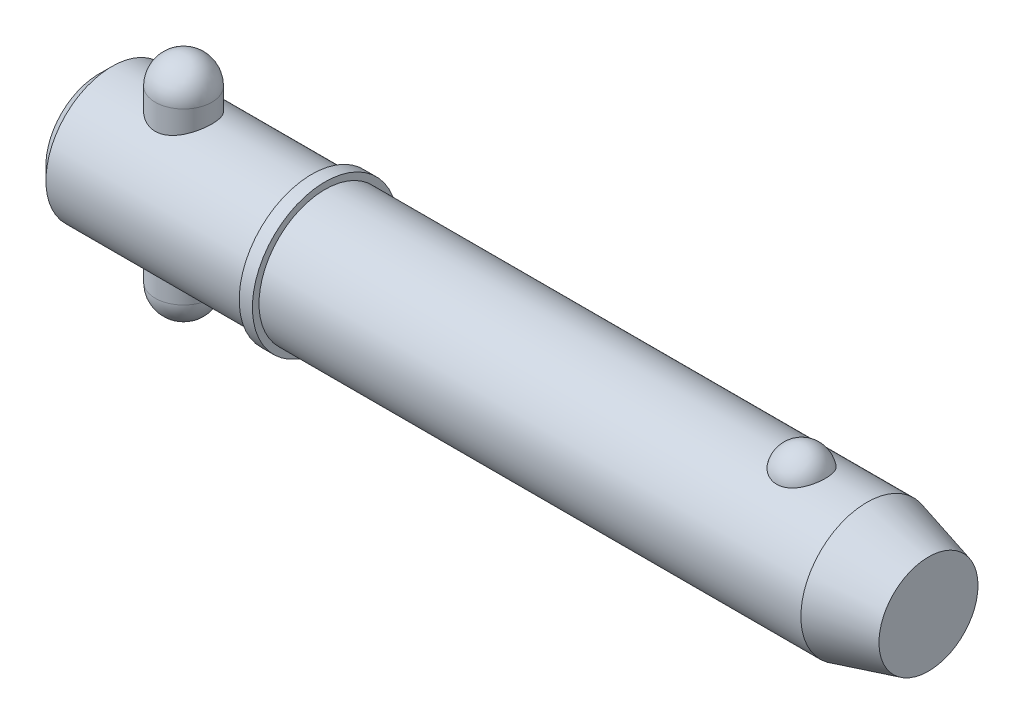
ISO-10303-21;
HEADER;
FILE_DESCRIPTION(('STEP AP214'),'2;1');
FILE_NAME('part.step','',(''),(''),'','','');
FILE_SCHEMA(('AUTOMOTIVE_DESIGN { 1 0 10303 214 1 1 1 1 }'));
ENDSEC;
DATA;
#1=APPLICATION_CONTEXT('core data for automotive mechanical design processes');
#2=APPLICATION_PROTOCOL_DEFINITION('international standard','automotive_design',2000,#1);
#3=PRODUCT_CONTEXT('',#1,'mechanical');
#4=PRODUCT('Part','Part','',(#3));
#5=PRODUCT_RELATED_PRODUCT_CATEGORY('part','',(#4));
#6=PRODUCT_DEFINITION_FORMATION('','',#4);
#7=PRODUCT_DEFINITION_CONTEXT('part definition',#1,'design');
#8=PRODUCT_DEFINITION('design','',#6,#7);
#9=PRODUCT_DEFINITION_SHAPE('','',#8);
#10=(LENGTH_UNIT() NAMED_UNIT(*) SI_UNIT(.MILLI.,.METRE.));
#11=(NAMED_UNIT(*) PLANE_ANGLE_UNIT() SI_UNIT($,.RADIAN.));
#12=(NAMED_UNIT(*) SI_UNIT($,.STERADIAN.) SOLID_ANGLE_UNIT());
#13=UNCERTAINTY_MEASURE_WITH_UNIT(LENGTH_MEASURE(1.E-05),#10,'distance_accuracy_value','');
#14=(GEOMETRIC_REPRESENTATION_CONTEXT(3) GLOBAL_UNCERTAINTY_ASSIGNED_CONTEXT((#13)) GLOBAL_UNIT_ASSIGNED_CONTEXT((#10,
#11,#12)) REPRESENTATION_CONTEXT('',''));
#15=CARTESIAN_POINT('',(0.,0.,0.));
#16=DIRECTION('',(0.,0.,1.));
#17=DIRECTION('',(1.,0.,0.));
#18=AXIS2_PLACEMENT_3D('',#15,#16,#17);
#19=CARTESIAN_POINT('',(14.28,19.05,0.));
#20=DIRECTION('',(0.,-1.,0.));
#21=DIRECTION('',(0.,0.,-1.));
#22=AXIS2_PLACEMENT_3D('',#19,#20,#21);
#23=CYLINDRICAL_SURFACE('',#22,4.76);
#24=CARTESIAN_POINT('',(14.28,-14.29,0.));
#25=DIRECTION('',(0.,-1.,0.));
#26=DIRECTION('',(0.,0.,-1.));
#27=AXIS2_PLACEMENT_3D('',#24,#25,#26);
#28=CIRCLE('',#27,4.76);
#29=CARTESIAN_POINT('',(14.28,-14.29,-4.76));
#30=VERTEX_POINT('',#29);
#31=EDGE_CURVE('P0_E10',#30,#30,#28,.F.);
#32=CARTESIAN_POINT('',(14.28,14.29,0.));
#33=DIRECTION('',(0.,-1.,0.));
#34=DIRECTION('',(0.,0.,-1.));
#35=AXIS2_PLACEMENT_3D('',#32,#33,#34);
#36=CIRCLE('',#35,4.76);
#37=CARTESIAN_POINT('',(14.28,14.29,-4.76));
#38=VERTEX_POINT('',#37);
#39=EDGE_CURVE('P0_E21',#38,#38,#36,.T.);
#40=CARTESIAN_POINT('',(14.28,-14.29,-4.76));
#41=CARTESIAN_POINT('',(14.28,-13.9922916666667,-4.76));
#42=CARTESIAN_POINT('',(14.28,-13.6945833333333,-4.76));
#43=CARTESIAN_POINT('',(14.28,-13.0991666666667,-4.76));
#44=CARTESIAN_POINT('',(14.28,-12.8014583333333,-4.76));
#45=CARTESIAN_POINT('',(14.28,-12.2060416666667,-4.76));
#46=CARTESIAN_POINT('',(14.28,-11.9083333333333,-4.76));
#47=CARTESIAN_POINT('',(14.28,-11.3129166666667,-4.76));
#48=CARTESIAN_POINT('',(14.28,-11.0152083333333,-4.76));
#49=CARTESIAN_POINT('',(14.28,-10.4197916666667,-4.76));
#50=CARTESIAN_POINT('',(14.28,-10.1220833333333,-4.76));
#51=CARTESIAN_POINT('',(14.28,-9.52666666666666,-4.76));
#52=CARTESIAN_POINT('',(14.28,-9.22895833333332,-4.76));
#53=CARTESIAN_POINT('',(14.28,-8.63354166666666,-4.76));
#54=CARTESIAN_POINT('',(14.28,-8.33583333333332,-4.76));
#55=CARTESIAN_POINT('',(14.28,-7.74041666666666,-4.76));
#56=CARTESIAN_POINT('',(14.28,-7.44270833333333,-4.76));
#57=CARTESIAN_POINT('',(14.28,-6.84729166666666,-4.76));
#58=CARTESIAN_POINT('',(14.28,-6.54958333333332,-4.76));
#59=CARTESIAN_POINT('',(14.28,-5.95416666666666,-4.76));
#60=CARTESIAN_POINT('',(14.28,-5.65645833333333,-4.76));
#61=CARTESIAN_POINT('',(14.28,-5.06104166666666,-4.76));
#62=CARTESIAN_POINT('',(14.28,-4.76333333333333,-4.76));
#63=CARTESIAN_POINT('',(14.28,-4.16791666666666,-4.76));
#64=CARTESIAN_POINT('',(14.28,-3.87020833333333,-4.76));
#65=CARTESIAN_POINT('',(14.28,-3.27479166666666,-4.76));
#66=CARTESIAN_POINT('',(14.28,-2.97708333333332,-4.76));
#67=CARTESIAN_POINT('',(14.28,-2.38166666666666,-4.76));
#68=CARTESIAN_POINT('',(14.28,-2.08395833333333,-4.76));
#69=CARTESIAN_POINT('',(14.28,-1.48854166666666,-4.76));
#70=CARTESIAN_POINT('',(14.28,-1.19083333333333,-4.76));
#71=CARTESIAN_POINT('',(14.28,-0.595416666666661,-4.76));
#72=CARTESIAN_POINT('',(14.28,-0.297708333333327,-4.76));
#73=CARTESIAN_POINT('',(14.28,0.297708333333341,-4.76));
#74=CARTESIAN_POINT('',(14.28,0.595416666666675,-4.76));
#75=CARTESIAN_POINT('',(14.28,1.19083333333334,-4.76));
#76=CARTESIAN_POINT('',(14.28,1.48854166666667,-4.76));
#77=CARTESIAN_POINT('',(14.28,2.08395833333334,-4.76));
#78=CARTESIAN_POINT('',(14.28,2.38166666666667,-4.76));
#79=CARTESIAN_POINT('',(14.28,2.97708333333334,-4.76));
#80=CARTESIAN_POINT('',(14.28,3.27479166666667,-4.76));
#81=CARTESIAN_POINT('',(14.28,3.87020833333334,-4.76));
#82=CARTESIAN_POINT('',(14.28,4.16791666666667,-4.76));
#83=CARTESIAN_POINT('',(14.28,4.76333333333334,-4.76));
#84=CARTESIAN_POINT('',(14.28,5.06104166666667,-4.76));
#85=CARTESIAN_POINT('',(14.28,5.65645833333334,-4.76));
#86=CARTESIAN_POINT('',(14.28,5.95416666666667,-4.76));
#87=CARTESIAN_POINT('',(14.28,6.54958333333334,-4.76));
#88=CARTESIAN_POINT('',(14.28,6.84729166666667,-4.76));
#89=CARTESIAN_POINT('',(14.28,7.44270833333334,-4.76));
#90=CARTESIAN_POINT('',(14.28,7.74041666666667,-4.76));
#91=CARTESIAN_POINT('',(14.28,8.33583333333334,-4.76));
#92=CARTESIAN_POINT('',(14.28,8.63354166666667,-4.76));
#93=CARTESIAN_POINT('',(14.28,9.22895833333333,-4.76));
#94=CARTESIAN_POINT('',(14.28,9.52666666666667,-4.76));
#95=CARTESIAN_POINT('',(14.28,10.1220833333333,-4.76));
#96=CARTESIAN_POINT('',(14.28,10.4197916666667,-4.76));
#97=CARTESIAN_POINT('',(14.28,11.0152083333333,-4.76));
#98=CARTESIAN_POINT('',(14.28,11.3129166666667,-4.76));
#99=CARTESIAN_POINT('',(14.28,11.9083333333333,-4.76));
#100=CARTESIAN_POINT('',(14.28,12.2060416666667,-4.76));
#101=CARTESIAN_POINT('',(14.28,12.8014583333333,-4.76));
#102=CARTESIAN_POINT('',(14.28,13.0991666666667,-4.76));
#103=CARTESIAN_POINT('',(14.28,13.6945833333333,-4.76));
#104=CARTESIAN_POINT('',(14.28,13.9922916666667,-4.76));
#105=CARTESIAN_POINT('',(14.28,14.29,-4.76));
#106=B_SPLINE_CURVE_WITH_KNOTS('',3,(#40,#41,#42,#43,#44,#45,#46,#47,#48,#49,#50,#51,#52,#53,
#54,#55,#56,#57,#58,#59,#60,#61,#62,#63,#64,#65,#66,#67,#68,#69,#70,#71,#72,#73,#74,#75,#76,#77,
#78,#79,#80,#81,#82,#83,#84,#85,#86,#87,#88,#89,#90,#91,#92,#93,#94,#95,#96,#97,#98,#99,#100,
#101,#102,#103,#104,#105),.UNSPECIFIED.,.F.,.F.,(4,2,2,2,2,2,2,2,2,2,2,2,2,2,2,2,2,2,2,2,2,2,2,
2,2,2,2,2,2,2,2,2,4),(0.,0.893125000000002,1.78625,2.67937499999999,3.5725,4.465625,5.35875,
6.25187499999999,7.145,8.038125,8.93125,9.82437499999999,10.7175,11.610625,12.50375,13.396875,
14.29,15.183125,16.07625,16.969375,17.8625,18.755625,19.64875,20.541875,21.435,22.328125,
23.22125,24.114375,25.0075,25.900625,26.79375,27.686875,28.58),.UNSPECIFIED.);
#107=EDGE_CURVE('P0_BSEAM14',#30,#38,#106,.T.);
#108=ORIENTED_EDGE('',*,*,#31,.T.);
#109=ORIENTED_EDGE('',*,*,#39,.T.);
#110=ORIENTED_EDGE('',*,*,#107,.T.);
#111=ORIENTED_EDGE('',*,*,#107,.F.);
#112=EDGE_LOOP('',(#108,#110,#109,#111));
#113=FACE_BOUND('',#112,.T.);
#114=ADVANCED_FACE('P0_F14',(#113),#23,.T.);
#115=CARTESIAN_POINT('',(14.28,-14.29,0.));
#116=DIRECTION('',(0.,0.,1.));
#117=DIRECTION('',(1.,0.,0.));
#118=AXIS2_PLACEMENT_3D('',#115,#116,#117);
#119=SPHERICAL_SURFACE('',#118,4.76);
#120=CARTESIAN_POINT('',(14.28,-14.29,0.));
#121=DIRECTION('',(0.,-1.,0.));
#122=DIRECTION('',(0.,0.,-1.));
#123=AXIS2_PLACEMENT_3D('',#120,#121,#122);
#124=SPHERICAL_SURFACE('',#123,4.76);
#125=ORIENTED_EDGE('',*,*,#31,.F.);
#126=EDGE_LOOP('',(#125));
#127=FACE_BOUND('',#126,.T.);
#128=ADVANCED_FACE('P0_F29',(#127),#124,.T.);
#129=CARTESIAN_POINT('',(14.28,14.29,0.));
#130=DIRECTION('',(0.,0.,1.));
#131=DIRECTION('',(1.,0.,0.));
#132=AXIS2_PLACEMENT_3D('',#129,#130,#131);
#133=SPHERICAL_SURFACE('',#132,4.76);
#134=CARTESIAN_POINT('',(14.28,14.29,0.));
#135=DIRECTION('',(0.,-1.,0.));
#136=DIRECTION('',(0.,0.,-1.));
#137=AXIS2_PLACEMENT_3D('',#134,#135,#136);
#138=SPHERICAL_SURFACE('',#137,4.76);
#139=ORIENTED_EDGE('',*,*,#39,.F.);
#140=EDGE_LOOP('',(#139));
#141=FACE_BOUND('',#140,.T.);
#142=ADVANCED_FACE('P0_F16',(#141),#138,.T.);
#143=CLOSED_SHELL('',(#114,#128,#142));
#144=MANIFOLD_SOLID_BREP('P0_B1',#143);
#145=CARTESIAN_POINT('',(0.,0.,0.));
#146=DIRECTION('',(1.,0.,0.));
#147=DIRECTION('',(0.,0.,-1.));
#148=AXIS2_PLACEMENT_3D('',#145,#146,#147);
#149=CYLINDRICAL_SURFACE('',#148,11.115);
#150=CARTESIAN_POINT('',(129.329563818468,0.,0.));
#151=DIRECTION('',(1.,0.,0.));
#152=DIRECTION('',(0.,0.,-1.));
#153=AXIS2_PLACEMENT_3D('',#150,#151,#152);
#154=CIRCLE('',#153,11.115);
#155=CARTESIAN_POINT('',(129.329563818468,0.,-11.115));
#156=VERTEX_POINT('',#155);
#157=EDGE_CURVE('P1_E81',#156,#156,#154,.T.);
#158=ORIENTED_EDGE('',*,*,#157,.F.);
#159=EDGE_LOOP('',(#158));
#160=FACE_BOUND('',#159,.T.);
#161=CARTESIAN_POINT('',(38.1,0.,0.));
#162=DIRECTION('',(1.,0.,0.));
#163=DIRECTION('',(0.,0.,-1.));
#164=AXIS2_PLACEMENT_3D('',#161,#162,#163);
#165=CIRCLE('',#164,11.115);
#166=CARTESIAN_POINT('',(38.1,0.,-11.115));
#167=VERTEX_POINT('',#166);
#168=EDGE_CURVE('P1_E85',#167,#167,#165,.T.);
#169=ORIENTED_EDGE('',*,*,#168,.T.);
#170=EDGE_LOOP('',(#169));
#171=FACE_BOUND('',#170,.T.);
#172=CARTESIAN_POINT('',(118.331068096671,10.3028087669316,4.17077409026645));
#173=CARTESIAN_POINT('',(118.114775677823,10.3028003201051,4.17078240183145));
#174=CARTESIAN_POINT('',(117.898548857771,10.3098895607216,4.15340593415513));
#175=CARTESIAN_POINT('',(117.472540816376,10.3373834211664,4.08449540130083));
#176=CARTESIAN_POINT('',(117.262757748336,10.3577841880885,4.0329712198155));
#177=CARTESIAN_POINT('',(116.855782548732,10.4095237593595,3.89746513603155));
#178=CARTESIAN_POINT('',(116.658572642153,10.4408466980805,3.81353029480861));
#179=CARTESIAN_POINT('',(116.281338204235,10.5110236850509,3.61560339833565));
#180=CARTESIAN_POINT('',(116.101317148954,10.5498792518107,3.50160528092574));
#181=CARTESIAN_POINT('',(115.757684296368,10.6322884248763,3.24292464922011));
#182=CARTESIAN_POINT('',(115.594686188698,10.6759443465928,3.09746040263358));
#183=CARTESIAN_POINT('',(115.294591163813,10.7625291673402,2.78171925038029));
#184=CARTESIAN_POINT('',(115.157499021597,10.8054579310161,2.61143778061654));
#185=CARTESIAN_POINT('',(114.906408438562,10.8881935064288,2.24226695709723));
#186=CARTESIAN_POINT('',(114.793710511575,10.9277761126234,2.04244123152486));
#187=CARTESIAN_POINT('',(114.601777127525,10.997484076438,1.62578254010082));
#188=CARTESIAN_POINT('',(114.522544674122,11.0276085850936,1.40894804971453));
#189=CARTESIAN_POINT('',(114.398303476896,11.0756732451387,0.961250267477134));
#190=CARTESIAN_POINT('',(114.353760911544,11.0934470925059,0.730239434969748));
#191=CARTESIAN_POINT('',(114.301569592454,11.1143331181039,0.263439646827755));
#192=CARTESIAN_POINT('',(114.293920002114,11.1174456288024,0.0276507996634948));
#193=CARTESIAN_POINT('',(114.31561056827,11.1087161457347,-0.440729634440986));
#194=CARTESIAN_POINT('',(114.344762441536,11.0969502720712,-0.673331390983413));
#195=CARTESIAN_POINT('',(114.439143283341,11.0597872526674,-1.12996621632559));
#196=CARTESIAN_POINT('',(114.504372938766,11.0343898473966,-1.35399912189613));
#197=CARTESIAN_POINT('',(114.66969844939,10.972515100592,-1.78750286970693));
#198=CARTESIAN_POINT('',(114.76983863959,10.9360236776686,-1.99695478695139));
#199=CARTESIAN_POINT('',(115.002940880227,10.8557595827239,-2.39520667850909));
#200=CARTESIAN_POINT('',(115.135905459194,10.8119863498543,-2.5840050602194));
#201=CARTESIAN_POINT('',(115.432407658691,10.7216733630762,-2.93635726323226));
#202=CARTESIAN_POINT('',(115.596056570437,10.675123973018,-3.09981510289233));
#203=CARTESIAN_POINT('',(115.949860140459,10.5846571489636,-3.39592247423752));
#204=CARTESIAN_POINT('',(116.140012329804,10.5407394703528,-3.52857487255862));
#205=CARTESIAN_POINT('',(116.53750141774,10.4616690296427,-3.75646057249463));
#206=CARTESIAN_POINT('',(116.74436705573,10.4263443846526,-3.8524543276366));
#207=CARTESIAN_POINT('',(117.172954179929,10.3675574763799,-4.00798747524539));
#208=CARTESIAN_POINT('',(117.394670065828,10.344090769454,-4.0675405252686));
#209=CARTESIAN_POINT('',(117.834669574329,10.3128282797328,-4.14614314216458));
#210=CARTESIAN_POINT('',(118.052565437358,10.3043040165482,-4.1670783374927));
#211=CARTESIAN_POINT('',(118.48894951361,10.3016771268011,-4.17357158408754));
#212=CARTESIAN_POINT('',(118.707437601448,10.3075716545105,-4.15913661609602));
#213=CARTESIAN_POINT('',(119.131744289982,10.3326686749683,-4.09636961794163));
#214=CARTESIAN_POINT('',(119.337745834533,10.3514555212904,-4.0490957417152));
#215=CARTESIAN_POINT('',(119.738576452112,10.399818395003,-3.92320197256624));
#216=CARTESIAN_POINT('',(119.9334046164,10.4293952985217,-3.84457953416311));
#217=CARTESIAN_POINT('',(120.311191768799,10.4969600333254,-3.65612410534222));
#218=CARTESIAN_POINT('',(120.493797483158,10.5351178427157,-3.54564545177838));
#219=CARTESIAN_POINT('',(120.838204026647,10.6154999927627,-3.29718036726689));
#220=CARTESIAN_POINT('',(121.000000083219,10.657725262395,-3.15918764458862));
#221=CARTESIAN_POINT('',(121.306959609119,10.744212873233,-2.85163580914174));
#222=CARTESIAN_POINT('',(121.450891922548,10.7884718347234,-2.68084605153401));
#223=CARTESIAN_POINT('',(121.709237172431,10.872374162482,-2.3172186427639));
#224=CARTESIAN_POINT('',(121.823644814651,10.9120167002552,-2.12437704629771));
#225=CARTESIAN_POINT('',(122.023873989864,10.9838919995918,-1.71516999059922));
#226=CARTESIAN_POINT('',(122.10866178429,11.0158465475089,-1.498248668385));
#227=CARTESIAN_POINT('',(122.24268382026,11.0673523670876,-1.052285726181));
#228=CARTESIAN_POINT('',(122.291917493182,11.086903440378,-0.823243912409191));
#229=CARTESIAN_POINT('',(122.353891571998,11.1116323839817,-0.359087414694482));
#230=CARTESIAN_POINT('',(122.366566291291,11.1167843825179,-0.123962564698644));
#231=CARTESIAN_POINT('',(122.354973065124,11.1121144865,0.345220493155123));
#232=CARTESIAN_POINT('',(122.330705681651,11.1022928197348,0.579278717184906));
#233=CARTESIAN_POINT('',(122.245907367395,11.0687504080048,1.03866534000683));
#234=CARTESIAN_POINT('',(122.185529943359,11.0450885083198,1.26402641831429));
#235=CARTESIAN_POINT('',(122.029853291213,10.9863185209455,1.70076772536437));
#236=CARTESIAN_POINT('',(121.934551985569,10.9512097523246,1.91214712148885));
#237=CARTESIAN_POINT('',(121.710397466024,10.8729733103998,2.31608359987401));
#238=CARTESIAN_POINT('',(121.581380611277,10.8298068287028,2.50854240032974));
#239=CARTESIAN_POINT('',(121.292732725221,10.7401896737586,2.86808766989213));
#240=CARTESIAN_POINT('',(121.133102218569,10.6937390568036,3.03517457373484));
#241=CARTESIAN_POINT('',(120.787534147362,10.6029321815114,3.33857581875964));
#242=CARTESIAN_POINT('',(120.601708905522,10.5585680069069,3.47501541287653));
#243=CARTESIAN_POINT('',(120.207875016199,10.4769321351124,3.71390897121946));
#244=CARTESIAN_POINT('',(119.999863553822,10.439661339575,3.81635861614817));
#245=CARTESIAN_POINT('',(119.554066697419,10.3749407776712,3.98910631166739));
#246=CARTESIAN_POINT('',(119.315234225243,10.3482457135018,4.05700929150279));
#247=CARTESIAN_POINT('',(118.827925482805,10.312188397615,4.14782844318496));
#248=CARTESIAN_POINT('',(118.579453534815,10.3028184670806,4.17076454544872));
#249=CARTESIAN_POINT('',(118.331068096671,10.3028087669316,4.17077409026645));
#250=B_SPLINE_CURVE_WITH_KNOTS('',3,(#172,#173,#174,#175,#176,#177,#178,#179,#180,#181,#182,
#183,#184,#185,#186,#187,#188,#189,#190,#191,#192,#193,#194,#195,#196,#197,#198,#199,#200,#201,
#202,#203,#204,#205,#206,#207,#208,#209,#210,#211,#212,#213,#214,#215,#216,#217,#218,#219,#220,
#221,#222,#223,#224,#225,#226,#227,#228,#229,#230,#231,#232,#233,#234,#235,#236,#237,#238,#239,
#240,#241,#242,#243,#244,#245,#246,#247,#248,#249),.UNSPECIFIED.,.T.,.F.,(4,2,2,2,2,2,2,2,2,2,2,
2,2,2,2,2,2,2,2,2,2,2,2,2,2,2,2,2,2,2,2,2,2,2,2,2,2,2,4),(0.,0.647966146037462,1.29574482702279,
1.94258643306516,2.58955857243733,3.25496465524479,3.92049326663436,4.61566368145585,
5.3108964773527,6.01531821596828,6.71972398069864,7.42054043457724,8.12137023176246,
8.82309331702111,9.52487047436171,10.2292439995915,10.9335519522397,11.6223330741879,
12.3108558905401,12.9647664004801,13.6185478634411,14.2521847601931,14.8858731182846,
15.5334360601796,16.1811472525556,16.8611459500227,17.5412664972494,18.2431855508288,
18.9451158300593,19.6483065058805,20.3514864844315,21.0516982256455,21.7519516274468,
22.4556690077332,23.1593743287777,23.8601491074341,24.5610129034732,25.3054529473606,
26.049562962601),.UNSPECIFIED.);
#251=CARTESIAN_POINT('',(118.331068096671,10.3028087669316,4.17077409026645));
#252=VERTEX_POINT('',#251);
#253=EDGE_CURVE('P1_E35',#252,#252,#250,.T.);
#254=ORIENTED_EDGE('',*,*,#253,.T.);
#255=EDGE_LOOP('',(#254));
#256=FACE_BOUND('',#255,.T.);
#257=ADVANCED_FACE('P1_F13',(#160,#171,#256),#149,.T.);
#258=CARTESIAN_POINT('',(0.,0.,0.));
#259=DIRECTION('',(-1.,0.,0.));
#260=DIRECTION('',(0.,0.,1.));
#261=AXIS2_PLACEMENT_3D('',#258,#259,#260);
#262=PLANE('',#261);
#263=CARTESIAN_POINT('',(0.,0.,0.));
#264=DIRECTION('',(1.,0.,0.));
#265=DIRECTION('',(0.,0.,-1.));
#266=AXIS2_PLACEMENT_3D('',#263,#264,#265);
#267=CIRCLE('',#266,8.892);
#268=CARTESIAN_POINT('',(0.,0.,-8.892));
#269=VERTEX_POINT('',#268);
#270=EDGE_CURVE('P1_E9',#269,#269,#267,.T.);
#271=ORIENTED_EDGE('',*,*,#270,.F.);
#272=EDGE_LOOP('',(#271));
#273=FACE_BOUND('',#272,.T.);
#274=ADVANCED_FACE('P1_F15',(#273),#262,.T.);
#275=CARTESIAN_POINT('',(2.22299999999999,0.,0.));
#276=DIRECTION('',(1.,0.,0.));
#277=DIRECTION('',(0.,0.,-1.));
#278=AXIS2_PLACEMENT_3D('',#275,#276,#277);
#279=CONICAL_SURFACE('',#278,11.115,0.78539816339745);
#280=ORIENTED_EDGE('',*,*,#270,.T.);
#281=EDGE_LOOP('',(#280));
#282=FACE_BOUND('',#281,.T.);
#283=CARTESIAN_POINT('',(2.22299999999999,0.,0.));
#284=DIRECTION('',(1.,0.,0.));
#285=DIRECTION('',(0.,0.,-1.));
#286=AXIS2_PLACEMENT_3D('',#283,#284,#285);
#287=CIRCLE('',#286,11.115);
#288=CARTESIAN_POINT('',(2.22299999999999,0.,-11.115));
#289=VERTEX_POINT('',#288);
#290=EDGE_CURVE('P1_E26',#289,#289,#287,.T.);
#291=ORIENTED_EDGE('',*,*,#290,.F.);
#292=EDGE_LOOP('',(#291));
#293=FACE_BOUND('',#292,.T.);
#294=ADVANCED_FACE('P1_F77',(#282,#293),#279,.T.);
#295=CARTESIAN_POINT('',(0.,0.,0.));
#296=DIRECTION('',(1.,0.,0.));
#297=DIRECTION('',(0.,0.,-1.));
#298=AXIS2_PLACEMENT_3D('',#295,#296,#297);
#299=CYLINDRICAL_SURFACE('',#298,11.115);
#300=CARTESIAN_POINT('',(14.28,-10.0441836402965,4.76));
#301=CARTESIAN_POINT('',(14.1533731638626,-10.0441846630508,4.75999904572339));
#302=CARTESIAN_POINT('',(14.0267055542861,-10.0465865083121,4.75493985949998));
#303=CARTESIAN_POINT('',(13.774298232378,-10.0561141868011,4.73475585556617));
#304=CARTESIAN_POINT('',(13.6485591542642,-10.0632429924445,4.71962470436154));
#305=CARTESIAN_POINT('',(13.3987500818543,-10.0819979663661,4.67942666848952));
#306=CARTESIAN_POINT('',(13.2746840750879,-10.0936334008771,4.65433930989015));
#307=CARTESIAN_POINT('',(13.0293244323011,-10.1210146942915,4.59449317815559));
#308=CARTESIAN_POINT('',(12.9080319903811,-10.1367622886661,4.55973032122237));
#309=CARTESIAN_POINT('',(12.669614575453,-10.1717810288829,4.48106435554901));
#310=CARTESIAN_POINT('',(12.5524727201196,-10.1910352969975,4.4372048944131));
#311=CARTESIAN_POINT('',(12.3224300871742,-10.2325403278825,4.34063417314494));
#312=CARTESIAN_POINT('',(12.2095309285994,-10.2547922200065,4.28791957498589));
#313=CARTESIAN_POINT('',(11.8782785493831,-10.3250879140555,4.11715127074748));
#314=CARTESIAN_POINT('',(11.6670799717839,-10.3767168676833,3.98637638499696));
#315=CARTESIAN_POINT('',(11.2564039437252,-10.4874309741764,3.68567149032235));
#316=CARTESIAN_POINT('',(11.0583793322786,-10.5467772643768,3.51386978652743));
#317=CARTESIAN_POINT('',(10.6927724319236,-10.6641377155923,3.13969960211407));
#318=CARTESIAN_POINT('',(10.5252022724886,-10.7221513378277,2.93731900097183));
#319=CARTESIAN_POINT('',(10.2965609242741,-10.8050020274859,2.60935726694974));
#320=CARTESIAN_POINT('',(10.2227768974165,-10.8324811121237,2.49310321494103));
#321=CARTESIAN_POINT('',(10.0853380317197,-10.884703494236,2.25418999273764));
#322=CARTESIAN_POINT('',(10.0216789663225,-10.9094479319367,2.13153352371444));
#323=CARTESIAN_POINT('',(9.90506238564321,-10.9554932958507,1.88060370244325));
#324=CARTESIAN_POINT('',(9.85210574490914,-10.9767939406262,1.7523298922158));
#325=CARTESIAN_POINT('',(9.75746464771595,-11.0153112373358,1.49115740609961));
#326=CARTESIAN_POINT('',(9.71577447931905,-11.0325299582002,1.35826111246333));
#327=CARTESIAN_POINT('',(9.64605475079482,-11.0615607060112,1.09614539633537));
#328=CARTESIAN_POINT('',(9.61740732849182,-11.0736151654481,0.96711700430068));
#329=CARTESIAN_POINT('',(9.57092026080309,-11.0932687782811,0.706847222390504));
#330=CARTESIAN_POINT('',(9.55307574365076,-11.1008699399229,0.575606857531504));
#331=CARTESIAN_POINT('',(9.52838640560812,-11.1114054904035,0.31192917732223));
#332=CARTESIAN_POINT('',(9.52153986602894,-11.114340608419,0.179492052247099));
#333=CARTESIAN_POINT('',(9.51892405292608,-11.1154607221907,-0.0855090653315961));
#334=CARTESIAN_POINT('',(9.52315432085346,-11.1136459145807,-0.218073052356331));
#335=CARTESIAN_POINT('',(9.542009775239,-11.1055891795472,-0.473709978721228));
#336=CARTESIAN_POINT('',(9.55594693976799,-11.099640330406,-0.596843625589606));
#337=CARTESIAN_POINT('',(9.59332832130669,-11.0837823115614,-0.841440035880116));
#338=CARTESIAN_POINT('',(9.61677567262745,-11.0738718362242,-0.962902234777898));
#339=CARTESIAN_POINT('',(9.67294089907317,-11.0503378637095,-1.20325684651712));
#340=CARTESIAN_POINT('',(9.70565569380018,-11.0367156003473,-1.32215009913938));
#341=CARTESIAN_POINT('',(9.78005008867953,-11.0060908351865,-1.55666640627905));
#342=CARTESIAN_POINT('',(9.82173311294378,-10.9890870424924,-1.67228819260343));
#343=CARTESIAN_POINT('',(9.96110379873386,-10.9330280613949,-2.01656166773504));
#344=CARTESIAN_POINT('',(10.0722987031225,-10.8892801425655,-2.23915547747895));
#345=CARTESIAN_POINT('',(10.3268588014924,-10.7934745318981,-2.66299199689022));
#346=CARTESIAN_POINT('',(10.4702355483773,-10.7414138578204,-2.86422700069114));
#347=CARTESIAN_POINT('',(10.7973904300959,-10.6296201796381,-3.25557775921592));
#348=CARTESIAN_POINT('',(10.9833705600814,-10.569604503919,-3.443774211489));
#349=CARTESIAN_POINT('',(11.3844486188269,-10.4514707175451,-3.78722133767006));
#350=CARTESIAN_POINT('',(11.5995590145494,-10.3933534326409,-3.94245783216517));
#351=CARTESIAN_POINT('',(11.9444340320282,-10.311516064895,-4.14990014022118));
#352=CARTESIAN_POINT('',(12.0654579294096,-10.2847012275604,-4.21573894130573));
#353=CARTESIAN_POINT('',(12.3132718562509,-10.2342051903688,-4.33688518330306));
#354=CARTESIAN_POINT('',(12.4400593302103,-10.2105226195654,-4.39219723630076));
#355=CARTESIAN_POINT('',(12.6985418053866,-10.1671237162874,-4.49174500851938));
#356=CARTESIAN_POINT('',(12.8302359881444,-10.1474067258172,-4.53598256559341));
#357=CARTESIAN_POINT('',(13.0975061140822,-10.1126841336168,-4.61287629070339));
#358=CARTESIAN_POINT('',(13.233079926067,-10.0976759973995,-4.64553869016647));
#359=CARTESIAN_POINT('',(13.4978553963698,-10.0737863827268,-4.6971059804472));
#360=CARTESIAN_POINT('',(13.6268754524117,-10.0645618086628,-4.716785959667));
#361=CARTESIAN_POINT('',(13.8862990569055,-10.051062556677,-4.74548419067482));
#362=CARTESIAN_POINT('',(14.0167019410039,-10.0467856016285,-4.75450734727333));
#363=CARTESIAN_POINT('',(14.277859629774,-10.0433352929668,-4.76179143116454));
#364=CARTESIAN_POINT('',(14.4086143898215,-10.0441613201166,-4.76005366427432));
#365=CARTESIAN_POINT('',(14.6694025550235,-10.0508838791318,-4.74584231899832));
#366=CARTESIAN_POINT('',(14.7994359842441,-10.0567802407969,-4.73336910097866));
#367=CARTESIAN_POINT('',(15.0487369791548,-10.0728449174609,-4.69907984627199));
#368=CARTESIAN_POINT('',(15.1681238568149,-10.0826872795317,-4.67797462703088));
#369=CARTESIAN_POINT('',(15.4045894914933,-10.1062580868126,-4.62682977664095));
#370=CARTESIAN_POINT('',(15.5216674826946,-10.1199877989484,-4.59678723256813));
#371=CARTESIAN_POINT('',(15.868278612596,-10.1664161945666,-4.49365911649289));
#372=CARTESIAN_POINT('',(16.0933756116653,-10.2043671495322,-4.40754694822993));
#373=CARTESIAN_POINT('',(16.5357981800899,-10.2919879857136,-4.19898201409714));
#374=CARTESIAN_POINT('',(16.7523611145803,-10.3420954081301,-4.07511281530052));
#375=CARTESIAN_POINT('',(17.1627188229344,-10.4477911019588,-3.7959429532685));
#376=CARTESIAN_POINT('',(17.3565033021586,-10.5033818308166,-3.64062816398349));
#377=CARTESIAN_POINT('',(17.7334034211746,-10.6196376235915,-3.28693729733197));
#378=CARTESIAN_POINT('',(17.9141276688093,-10.6803237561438,-3.08599175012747));
#379=CARTESIAN_POINT('',(18.1582189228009,-10.7666348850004,-2.76320365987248));
#380=CARTESIAN_POINT('',(18.2351223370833,-10.7946346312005,-2.65197124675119));
#381=CARTESIAN_POINT('',(18.3793967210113,-10.8483267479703,-2.42297927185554));
#382=CARTESIAN_POINT('',(18.4467718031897,-10.87402011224,-2.30522255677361));
#383=CARTESIAN_POINT('',(18.5717669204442,-10.9225249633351,-2.06324665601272));
#384=CARTESIAN_POINT('',(18.6293326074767,-10.9453202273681,-1.93899615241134));
#385=CARTESIAN_POINT('',(18.73370006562,-10.9872100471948,-1.6855059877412));
#386=CARTESIAN_POINT('',(18.7805065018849,-11.0063062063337,-1.55626851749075));
#387=CARTESIAN_POINT('',(18.8628731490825,-11.0402419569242,-1.29375150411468));
#388=CARTESIAN_POINT('',(18.8984366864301,-11.0550828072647,-1.16047316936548));
#389=CARTESIAN_POINT('',(18.9579183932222,-11.0800638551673,-0.890912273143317));
#390=CARTESIAN_POINT('',(18.9818374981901,-11.0902044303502,-0.75462995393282));
#391=CARTESIAN_POINT('',(19.0164177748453,-11.104911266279,-0.490295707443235));
#392=CARTESIAN_POINT('',(19.027922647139,-11.1098318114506,-0.362373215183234));
#393=CARTESIAN_POINT('',(19.040554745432,-11.1152360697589,-0.105876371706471));
#394=CARTESIAN_POINT('',(19.0416784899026,-11.1157182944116,0.0226981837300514));
#395=CARTESIAN_POINT('',(19.0335275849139,-11.1122291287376,0.27938352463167));
#396=CARTESIAN_POINT('',(19.0242587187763,-11.1082602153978,0.407494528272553));
#397=CARTESIAN_POINT('',(18.9954320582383,-11.0959792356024,0.662388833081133));
#398=CARTESIAN_POINT('',(18.9758704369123,-11.0876655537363,0.789171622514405));
#399=CARTESIAN_POINT('',(18.9276379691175,-11.0673259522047,1.03545890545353));
#400=CARTESIAN_POINT('',(18.8993573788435,-11.0554596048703,1.15505309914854));
#401=CARTESIAN_POINT('',(18.8337694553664,-11.0282166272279,1.39134516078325));
#402=CARTESIAN_POINT('',(18.7964589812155,-11.0128387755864,1.5080420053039));
#403=CARTESIAN_POINT('',(18.671464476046,-10.9619666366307,1.85262797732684));
#404=CARTESIAN_POINT('',(18.5706772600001,-10.9217161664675,2.07521484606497));
#405=CARTESIAN_POINT('',(18.33202463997,-10.8301378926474,2.51061719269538));
#406=CARTESIAN_POINT('',(18.1926775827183,-10.7783885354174,2.72252375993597));
#407=CARTESIAN_POINT('',(17.8829747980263,-10.669863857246,3.12088015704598));
#408=CARTESIAN_POINT('',(17.7126068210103,-10.6130865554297,3.30731987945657));
#409=CARTESIAN_POINT('',(17.3310036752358,-10.495668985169,3.66358491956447));
#410=CARTESIAN_POINT('',(17.1177010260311,-10.4350471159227,3.83122543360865));
#411=CARTESIAN_POINT('',(16.7778915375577,-10.3495418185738,4.05420569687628));
#412=CARTESIAN_POINT('',(16.6612023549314,-10.3219229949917,4.12383380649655));
#413=CARTESIAN_POINT('',(16.4218466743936,-10.2693487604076,4.25306463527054));
#414=CARTESIAN_POINT('',(16.2991829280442,-10.2443921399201,4.31267191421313));
#415=CARTESIAN_POINT('',(16.0488008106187,-10.1979981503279,4.42126071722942));
#416=CARTESIAN_POINT('',(15.9210894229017,-10.1765561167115,4.47025635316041));
#417=CARTESIAN_POINT('',(15.6613937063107,-10.1379191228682,4.55720152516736));
#418=CARTESIAN_POINT('',(15.5294115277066,-10.1207220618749,4.59515652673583));
#419=CARTESIAN_POINT('',(15.2624981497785,-10.091252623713,4.65951684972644));
#420=CARTESIAN_POINT('',(15.1275757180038,-10.0789672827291,4.68595259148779));
#421=CARTESIAN_POINT('',(14.8556442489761,-10.0597530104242,4.72706206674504));
#422=CARTESIAN_POINT('',(14.7186368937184,-10.0528199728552,4.74174481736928));
#423=CARTESIAN_POINT('',(14.5310955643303,-10.047196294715,4.75363843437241));
#424=CARTESIAN_POINT('',(14.48091543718,-10.0460674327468,4.75602323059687));
#425=CARTESIAN_POINT('',(14.3804923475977,-10.044560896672,4.7592042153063));
#426=CARTESIAN_POINT('',(14.3302493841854,-10.0441832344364,4.76000037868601));
#427=CARTESIAN_POINT('',(14.28,-10.0441836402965,4.76));
#428=B_SPLINE_CURVE_WITH_KNOTS('',3,(#300,#301,#302,#303,#304,#305,#306,#307,#308,#309,#310,
#311,#312,#313,#314,#315,#316,#317,#318,#319,#320,#321,#322,#323,#324,#325,#326,#327,#328,#329,
#330,#331,#332,#333,#334,#335,#336,#337,#338,#339,#340,#341,#342,#343,#344,#345,#346,#347,#348,
#349,#350,#351,#352,#353,#354,#355,#356,#357,#358,#359,#360,#361,#362,#363,#364,#365,#366,#367,
#368,#369,#370,#371,#372,#373,#374,#375,#376,#377,#378,#379,#380,#381,#382,#383,#384,#385,#386,
#387,#388,#389,#390,#391,#392,#393,#394,#395,#396,#397,#398,#399,#400,#401,#402,#403,#404,#405,
#406,#407,#408,#409,#410,#411,#412,#413,#414,#415,#416,#417,#418,#419,#420,#421,#422,#423,#424,
#425,#426,#427),.UNSPECIFIED.,.T.,.F.,(4,2,2,2,2,2,2,2,2,2,2,2,2,2,2,2,2,2,2,2,2,2,2,2,2,2,2,2,
2,2,2,2,2,2,2,2,2,2,2,2,2,2,2,2,2,2,2,2,2,2,2,2,2,2,2,2,2,2,2,2,2,2,2,4),(0.,0.379828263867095,
0.759895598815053,1.14074858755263,1.52176256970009,1.90098898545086,2.28035867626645,
3.03818035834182,3.84125131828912,4.6446414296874,5.06541657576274,5.48601561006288,
5.90664899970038,6.3270687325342,6.72470503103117,7.12216187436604,7.51955659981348,
7.91693487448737,8.28868404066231,8.66055582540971,9.03230414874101,9.40419465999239,
10.1585834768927,10.9132435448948,11.7236471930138,12.5343987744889,12.9550196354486,
13.3754557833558,13.7958221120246,14.2159617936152,14.6079540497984,14.9997658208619,
15.3915300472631,15.7832811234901,16.1477615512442,16.512360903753,17.240999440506,
18.0012974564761,18.761937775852,19.5886929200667,20.0025782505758,20.4162843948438,
20.832212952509,21.2479608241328,21.6635855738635,22.0791769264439,22.4642880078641,
22.8495282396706,23.2345541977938,23.6197234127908,23.9896813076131,24.3597680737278,
25.099327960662,25.8726239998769,26.6462260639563,27.4759193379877,27.8914891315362,
28.3068693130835,28.7216936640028,29.1363123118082,29.5498292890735,29.9630287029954,
30.113753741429,30.2644811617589),.UNSPECIFIED.);
#429=CARTESIAN_POINT('',(14.28,-10.0441836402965,4.76));
#430=VERTEX_POINT('',#429);
#431=EDGE_CURVE('P1_E17',#430,#430,#428,.T.);
#432=ORIENTED_EDGE('',*,*,#431,.F.);
#433=EDGE_LOOP('',(#432));
#434=FACE_BOUND('',#433,.T.);
#435=CARTESIAN_POINT('',(14.28,10.0441836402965,4.76));
#436=CARTESIAN_POINT('',(14.4066268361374,10.0441846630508,4.75999904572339));
#437=CARTESIAN_POINT('',(14.5332944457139,10.0465865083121,4.75493985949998));
#438=CARTESIAN_POINT('',(14.785701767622,10.0561141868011,4.73475585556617));
#439=CARTESIAN_POINT('',(14.9114408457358,10.0632429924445,4.71962470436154));
#440=CARTESIAN_POINT('',(15.1612499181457,10.0819979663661,4.67942666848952));
#441=CARTESIAN_POINT('',(15.2853159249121,10.0936334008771,4.65433930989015));
#442=CARTESIAN_POINT('',(15.5306755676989,10.1210146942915,4.59449317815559));
#443=CARTESIAN_POINT('',(15.6519680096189,10.1367622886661,4.55973032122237));
#444=CARTESIAN_POINT('',(15.890385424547,10.1717810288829,4.48106435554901));
#445=CARTESIAN_POINT('',(16.0075272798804,10.1910352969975,4.4372048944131));
#446=CARTESIAN_POINT('',(16.2375699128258,10.2325403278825,4.34063417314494));
#447=CARTESIAN_POINT('',(16.3504690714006,10.2547922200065,4.28791957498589));
#448=CARTESIAN_POINT('',(16.6817214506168,10.3250879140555,4.11715127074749));
#449=CARTESIAN_POINT('',(16.8929200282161,10.3767168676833,3.98637638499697));
#450=CARTESIAN_POINT('',(17.3035960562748,10.4874309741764,3.68567149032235));
#451=CARTESIAN_POINT('',(17.5016206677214,10.5467772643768,3.51386978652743));
#452=CARTESIAN_POINT('',(17.8672275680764,10.6641377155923,3.13969960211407));
#453=CARTESIAN_POINT('',(18.0347977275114,10.7221513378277,2.93731900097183));
#454=CARTESIAN_POINT('',(18.2634390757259,10.8050020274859,2.60935726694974));
#455=CARTESIAN_POINT('',(18.3372231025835,10.8324811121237,2.49310321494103));
#456=CARTESIAN_POINT('',(18.4746619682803,10.884703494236,2.25418999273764));
#457=CARTESIAN_POINT('',(18.5383210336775,10.9094479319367,2.13153352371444));
#458=CARTESIAN_POINT('',(18.6549376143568,10.9554932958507,1.88060370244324));
#459=CARTESIAN_POINT('',(18.7078942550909,10.9767939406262,1.75232989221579));
#460=CARTESIAN_POINT('',(18.8025353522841,11.0153112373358,1.4911574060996));
#461=CARTESIAN_POINT('',(18.844225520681,11.0325299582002,1.35826111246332));
#462=CARTESIAN_POINT('',(18.9139452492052,11.0615607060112,1.09614539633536));
#463=CARTESIAN_POINT('',(18.9425926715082,11.0736151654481,0.967117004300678));
#464=CARTESIAN_POINT('',(18.9890797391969,11.0932687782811,0.706847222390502));
#465=CARTESIAN_POINT('',(19.0069242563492,11.1008699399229,0.575606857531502));
#466=CARTESIAN_POINT('',(19.0316135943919,11.1114054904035,0.311929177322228));
#467=CARTESIAN_POINT('',(19.0384601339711,11.114340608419,0.179492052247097));
#468=CARTESIAN_POINT('',(19.0410759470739,11.1154607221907,-0.0855090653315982));
#469=CARTESIAN_POINT('',(19.0368456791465,11.1136459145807,-0.218073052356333));
#470=CARTESIAN_POINT('',(19.017990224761,11.1055891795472,-0.47370997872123));
#471=CARTESIAN_POINT('',(19.004053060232,11.099640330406,-0.596843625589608));
#472=CARTESIAN_POINT('',(18.9666716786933,11.0837823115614,-0.841440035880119));
#473=CARTESIAN_POINT('',(18.9432243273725,11.0738718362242,-0.9629022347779));
#474=CARTESIAN_POINT('',(18.8870591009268,11.0503378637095,-1.20325684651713));
#475=CARTESIAN_POINT('',(18.8543443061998,11.0367156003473,-1.32215009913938));
#476=CARTESIAN_POINT('',(18.7799499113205,11.0060908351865,-1.55666640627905));
#477=CARTESIAN_POINT('',(18.7382668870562,10.9890870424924,-1.67228819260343));
#478=CARTESIAN_POINT('',(18.5988962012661,10.9330280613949,-2.01656166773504));
#479=CARTESIAN_POINT('',(18.4877012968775,10.8892801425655,-2.23915547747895));
#480=CARTESIAN_POINT('',(18.2331411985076,10.7934745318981,-2.66299199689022));
#481=CARTESIAN_POINT('',(18.0897644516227,10.7414138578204,-2.86422700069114));
#482=CARTESIAN_POINT('',(17.7626095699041,10.6296201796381,-3.25557775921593));
#483=CARTESIAN_POINT('',(17.5766294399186,10.569604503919,-3.443774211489));
#484=CARTESIAN_POINT('',(17.1755513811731,10.4514707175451,-3.78722133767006));
#485=CARTESIAN_POINT('',(16.9604409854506,10.3933534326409,-3.94245783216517));
#486=CARTESIAN_POINT('',(16.6155659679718,10.311516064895,-4.14990014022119));
#487=CARTESIAN_POINT('',(16.4945420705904,10.2847012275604,-4.21573894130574));
#488=CARTESIAN_POINT('',(16.2467281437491,10.2342051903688,-4.33688518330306));
#489=CARTESIAN_POINT('',(16.1199406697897,10.2105226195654,-4.39219723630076));
#490=CARTESIAN_POINT('',(15.8614581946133,10.1671237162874,-4.49174500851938));
#491=CARTESIAN_POINT('',(15.7297640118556,10.1474067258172,-4.53598256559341));
#492=CARTESIAN_POINT('',(15.4624938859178,10.1126841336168,-4.61287629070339));
#493=CARTESIAN_POINT('',(15.326920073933,10.0976759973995,-4.64553869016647));
#494=CARTESIAN_POINT('',(15.0621446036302,10.0737863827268,-4.6971059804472));
#495=CARTESIAN_POINT('',(14.9331245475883,10.0645618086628,-4.716785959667));
#496=CARTESIAN_POINT('',(14.6737009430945,10.051062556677,-4.74548419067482));
#497=CARTESIAN_POINT('',(14.543298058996,10.0467856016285,-4.75450734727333));
#498=CARTESIAN_POINT('',(14.2821403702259,10.0433352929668,-4.76179143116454));
#499=CARTESIAN_POINT('',(14.1513856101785,10.0441613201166,-4.76005366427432));
#500=CARTESIAN_POINT('',(13.8905974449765,10.0508838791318,-4.74584231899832));
#501=CARTESIAN_POINT('',(13.7605640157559,10.0567802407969,-4.73336910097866));
#502=CARTESIAN_POINT('',(13.5112630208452,10.0728449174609,-4.69907984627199));
#503=CARTESIAN_POINT('',(13.3918761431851,10.0826872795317,-4.67797462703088));
#504=CARTESIAN_POINT('',(13.1554105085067,10.1062580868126,-4.62682977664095));
#505=CARTESIAN_POINT('',(13.0383325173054,10.1199877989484,-4.59678723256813));
#506=CARTESIAN_POINT('',(12.691721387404,10.1664161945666,-4.49365911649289));
#507=CARTESIAN_POINT('',(12.4666243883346,10.2043671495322,-4.40754694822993));
#508=CARTESIAN_POINT('',(12.0242018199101,10.2919879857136,-4.19898201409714));
#509=CARTESIAN_POINT('',(11.8076388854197,10.3420954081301,-4.07511281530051));
#510=CARTESIAN_POINT('',(11.3972811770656,10.4477911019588,-3.7959429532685));
#511=CARTESIAN_POINT('',(11.2034966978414,10.5033818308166,-3.64062816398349));
#512=CARTESIAN_POINT('',(10.8265965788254,10.6196376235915,-3.28693729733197));
#513=CARTESIAN_POINT('',(10.6458723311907,10.6803237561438,-3.08599175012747));
#514=CARTESIAN_POINT('',(10.4017810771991,10.7666348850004,-2.76320365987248));
#515=CARTESIAN_POINT('',(10.3248776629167,10.7946346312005,-2.65197124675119));
#516=CARTESIAN_POINT('',(10.1806032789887,10.8483267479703,-2.42297927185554));
#517=CARTESIAN_POINT('',(10.1132281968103,10.87402011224,-2.30522255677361));
#518=CARTESIAN_POINT('',(9.98823307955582,10.9225249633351,-2.06324665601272));
#519=CARTESIAN_POINT('',(9.93066739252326,10.9453202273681,-1.93899615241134));
#520=CARTESIAN_POINT('',(9.82629993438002,10.9872100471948,-1.6855059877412));
#521=CARTESIAN_POINT('',(9.77949349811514,11.0063062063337,-1.55626851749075));
#522=CARTESIAN_POINT('',(9.69712685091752,11.0402419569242,-1.29375150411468));
#523=CARTESIAN_POINT('',(9.66156331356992,11.0550828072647,-1.16047316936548));
#524=CARTESIAN_POINT('',(9.60208160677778,11.0800638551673,-0.890912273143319));
#525=CARTESIAN_POINT('',(9.57816250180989,11.0902044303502,-0.754629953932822));
#526=CARTESIAN_POINT('',(9.54358222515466,11.104911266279,-0.490295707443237));
#527=CARTESIAN_POINT('',(9.53207735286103,11.1098318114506,-0.362373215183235));
#528=CARTESIAN_POINT('',(9.51944525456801,11.1152360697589,-0.105876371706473));
#529=CARTESIAN_POINT('',(9.51832151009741,11.1157182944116,0.0226981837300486));
#530=CARTESIAN_POINT('',(9.52647241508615,11.1122291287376,0.279383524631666));
#531=CARTESIAN_POINT('',(9.53574128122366,11.1082602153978,0.407494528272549));
#532=CARTESIAN_POINT('',(9.5645679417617,11.0959792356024,0.662388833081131));
#533=CARTESIAN_POINT('',(9.58412956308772,11.0876655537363,0.789171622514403));
#534=CARTESIAN_POINT('',(9.63236203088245,11.0673259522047,1.03545890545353));
#535=CARTESIAN_POINT('',(9.66064262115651,11.0554596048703,1.15505309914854));
#536=CARTESIAN_POINT('',(9.72623054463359,11.0282166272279,1.39134516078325));
#537=CARTESIAN_POINT('',(9.76354101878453,11.0128387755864,1.5080420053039));
#538=CARTESIAN_POINT('',(9.88853552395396,10.9619666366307,1.85262797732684));
#539=CARTESIAN_POINT('',(9.98932273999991,10.9217161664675,2.07521484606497));
#540=CARTESIAN_POINT('',(10.22797536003,10.8301378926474,2.51061719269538));
#541=CARTESIAN_POINT('',(10.3673224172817,10.7783885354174,2.72252375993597));
#542=CARTESIAN_POINT('',(10.6770252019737,10.669863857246,3.12088015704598));
#543=CARTESIAN_POINT('',(10.8473931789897,10.6130865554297,3.30731987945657));
#544=CARTESIAN_POINT('',(11.2289963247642,10.495668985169,3.66358491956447));
#545=CARTESIAN_POINT('',(11.4422989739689,10.4350471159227,3.83122543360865));
#546=CARTESIAN_POINT('',(11.7821084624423,10.3495418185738,4.05420569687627));
#547=CARTESIAN_POINT('',(11.8987976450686,10.3219229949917,4.12383380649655));
#548=CARTESIAN_POINT('',(12.1381533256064,10.2693487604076,4.25306463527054));
#549=CARTESIAN_POINT('',(12.2608170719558,10.2443921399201,4.31267191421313));
#550=CARTESIAN_POINT('',(12.5111991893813,10.1979981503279,4.42126071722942));
#551=CARTESIAN_POINT('',(12.6389105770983,10.1765561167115,4.47025635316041));
#552=CARTESIAN_POINT('',(12.8986062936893,10.1379191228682,4.55720152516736));
#553=CARTESIAN_POINT('',(13.0305884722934,10.1207220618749,4.59515652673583));
#554=CARTESIAN_POINT('',(13.2975018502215,10.091252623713,4.65951684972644));
#555=CARTESIAN_POINT('',(13.4324242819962,10.0789672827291,4.68595259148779));
#556=CARTESIAN_POINT('',(13.7043557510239,10.0597530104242,4.72706206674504));
#557=CARTESIAN_POINT('',(13.8413631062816,10.0528199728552,4.74174481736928));
#558=CARTESIAN_POINT('',(14.0289044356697,10.047196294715,4.75363843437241));
#559=CARTESIAN_POINT('',(14.07908456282,10.0460674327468,4.75602323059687));
#560=CARTESIAN_POINT('',(14.1795076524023,10.044560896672,4.7592042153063));
#561=CARTESIAN_POINT('',(14.2297506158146,10.0441832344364,4.76000037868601));
#562=CARTESIAN_POINT('',(14.28,10.0441836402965,4.76));
#563=B_SPLINE_CURVE_WITH_KNOTS('',3,(#435,#436,#437,#438,#439,#440,#441,#442,#443,#444,#445,
#446,#447,#448,#449,#450,#451,#452,#453,#454,#455,#456,#457,#458,#459,#460,#461,#462,#463,#464,
#465,#466,#467,#468,#469,#470,#471,#472,#473,#474,#475,#476,#477,#478,#479,#480,#481,#482,#483,
#484,#485,#486,#487,#488,#489,#490,#491,#492,#493,#494,#495,#496,#497,#498,#499,#500,#501,#502,
#503,#504,#505,#506,#507,#508,#509,#510,#511,#512,#513,#514,#515,#516,#517,#518,#519,#520,#521,
#522,#523,#524,#525,#526,#527,#528,#529,#530,#531,#532,#533,#534,#535,#536,#537,#538,#539,#540,
#541,#542,#543,#544,#545,#546,#547,#548,#549,#550,#551,#552,#553,#554,#555,#556,#557,#558,#559,
#560,#561,#562),.UNSPECIFIED.,.T.,.F.,(4,2,2,2,2,2,2,2,2,2,2,2,2,2,2,2,2,2,2,2,2,2,2,2,2,2,2,2,
2,2,2,2,2,2,2,2,2,2,2,2,2,2,2,2,2,2,2,2,2,2,2,2,2,2,2,2,2,2,2,2,2,2,2,4),(0.,0.379828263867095,
0.759895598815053,1.14074858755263,1.52176256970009,1.90098898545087,2.28035867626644,
3.03818035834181,3.84125131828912,4.6446414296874,5.06541657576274,5.48601561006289,
5.90664899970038,6.3270687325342,6.72470503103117,7.12216187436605,7.51955659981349,
7.91693487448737,8.28868404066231,8.66055582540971,9.03230414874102,9.4041946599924,
10.1585834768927,10.9132435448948,11.7236471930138,12.5343987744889,12.9550196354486,
13.3754557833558,13.7958221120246,14.2159617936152,14.6079540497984,14.9997658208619,
15.3915300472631,15.7832811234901,16.1477615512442,16.512360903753,17.240999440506,
18.0012974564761,18.761937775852,19.5886929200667,20.0025782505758,20.4162843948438,
20.832212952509,21.2479608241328,21.6635855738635,22.0791769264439,22.4642880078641,
22.8495282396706,23.2345541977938,23.6197234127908,23.9896813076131,24.3597680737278,
25.099327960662,25.8726239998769,26.6462260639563,27.4759193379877,27.8914891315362,
28.3068693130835,28.7216936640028,29.1363123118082,29.5498292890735,29.9630287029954,
30.113753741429,30.2644811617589),.UNSPECIFIED.);
#564=CARTESIAN_POINT('',(14.28,10.0441836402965,4.76));
#565=VERTEX_POINT('',#564);
#566=EDGE_CURVE('P1_E43',#565,#565,#563,.T.);
#567=ORIENTED_EDGE('',*,*,#566,.F.);
#568=EDGE_LOOP('',(#567));
#569=FACE_BOUND('',#568,.T.);
#570=ORIENTED_EDGE('',*,*,#290,.T.);
#571=EDGE_LOOP('',(#570));
#572=FACE_BOUND('',#571,.T.);
#573=CARTESIAN_POINT('',(35.877,0.,0.));
#574=DIRECTION('',(1.,0.,0.));
#575=DIRECTION('',(0.,0.,-1.));
#576=AXIS2_PLACEMENT_3D('',#573,#574,#575);
#577=CIRCLE('',#576,11.115);
#578=CARTESIAN_POINT('',(35.877,0.,-11.115));
#579=VERTEX_POINT('',#578);
#580=EDGE_CURVE('P1_E31',#579,#579,#577,.T.);
#581=ORIENTED_EDGE('',*,*,#580,.F.);
#582=EDGE_LOOP('',(#581));
#583=FACE_BOUND('',#582,.T.);
#584=ADVANCED_FACE('P1_F103',(#434,#569,#572,#583),#299,.T.);
#585=CARTESIAN_POINT('',(35.877,11.115,0.));
#586=DIRECTION('',(-1.,0.,0.));
#587=DIRECTION('',(0.,0.,1.));
#588=AXIS2_PLACEMENT_3D('',#585,#586,#587);
#589=PLANE('',#588);
#590=ORIENTED_EDGE('',*,*,#580,.T.);
#591=EDGE_LOOP('',(#590));
#592=FACE_BOUND('',#591,.T.);
#593=CARTESIAN_POINT('',(35.877,0.,0.));
#594=DIRECTION('',(1.,0.,0.));
#595=DIRECTION('',(0.,0.,-1.));
#596=AXIS2_PLACEMENT_3D('',#593,#594,#595);
#597=CIRCLE('',#596,12.2265);
#598=CARTESIAN_POINT('',(35.877,0.,-12.2265));
#599=VERTEX_POINT('',#598);
#600=EDGE_CURVE('P1_E91',#599,#599,#597,.T.);
#601=ORIENTED_EDGE('',*,*,#600,.F.);
#602=EDGE_LOOP('',(#601));
#603=FACE_BOUND('',#602,.T.);
#604=ADVANCED_FACE('P1_F100',(#592,#603),#589,.T.);
#605=CARTESIAN_POINT('',(0.,0.,0.));
#606=DIRECTION('',(1.,0.,0.));
#607=DIRECTION('',(0.,0.,-1.));
#608=AXIS2_PLACEMENT_3D('',#605,#606,#607);
#609=CYLINDRICAL_SURFACE('',#608,12.2265);
#610=ORIENTED_EDGE('',*,*,#600,.T.);
#611=EDGE_LOOP('',(#610));
#612=FACE_BOUND('',#611,.T.);
#613=CARTESIAN_POINT('',(38.1,0.,0.));
#614=DIRECTION('',(1.,0.,0.));
#615=DIRECTION('',(0.,0.,-1.));
#616=AXIS2_PLACEMENT_3D('',#613,#614,#615);
#617=CIRCLE('',#616,12.2265);
#618=CARTESIAN_POINT('',(38.1,0.,-12.2265));
#619=VERTEX_POINT('',#618);
#620=EDGE_CURVE('P1_E88',#619,#619,#617,.T.);
#621=ORIENTED_EDGE('',*,*,#620,.F.);
#622=EDGE_LOOP('',(#621));
#623=FACE_BOUND('',#622,.T.);
#624=ADVANCED_FACE('P1_F68',(#612,#623),#609,.T.);
#625=CARTESIAN_POINT('',(38.1,12.2265,0.));
#626=DIRECTION('',(1.,0.,0.));
#627=DIRECTION('',(0.,0.,-1.));
#628=AXIS2_PLACEMENT_3D('',#625,#626,#627);
#629=PLANE('',#628);
#630=ORIENTED_EDGE('',*,*,#620,.T.);
#631=EDGE_LOOP('',(#630));
#632=FACE_BOUND('',#631,.T.);
#633=ORIENTED_EDGE('',*,*,#168,.F.);
#634=EDGE_LOOP('',(#633));
#635=FACE_BOUND('',#634,.T.);
#636=ADVANCED_FACE('P1_F62',(#632,#635),#629,.T.);
#637=CARTESIAN_POINT('',(139.7,0.,0.));
#638=DIRECTION('',(-1.,0.,0.));
#639=DIRECTION('',(0.,0.,1.));
#640=AXIS2_PLACEMENT_3D('',#637,#638,#639);
#641=CONICAL_SURFACE('',#640,8.33625000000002,0.261799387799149);
#642=ORIENTED_EDGE('',*,*,#157,.T.);
#643=EDGE_LOOP('',(#642));
#644=FACE_BOUND('',#643,.T.);
#645=CARTESIAN_POINT('',(139.7,0.,0.));
#646=DIRECTION('',(1.,0.,0.));
#647=DIRECTION('',(0.,0.,-1.));
#648=AXIS2_PLACEMENT_3D('',#645,#646,#647);
#649=CIRCLE('',#648,8.33625000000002);
#650=CARTESIAN_POINT('',(139.7,0.,-8.33625000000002));
#651=VERTEX_POINT('',#650);
#652=EDGE_CURVE('P1_E42',#651,#651,#649,.T.);
#653=ORIENTED_EDGE('',*,*,#652,.F.);
#654=EDGE_LOOP('',(#653));
#655=FACE_BOUND('',#654,.T.);
#656=ADVANCED_FACE('P1_F59',(#644,#655),#641,.T.);
#657=CARTESIAN_POINT('',(139.7,8.33625000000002,0.));
#658=DIRECTION('',(1.,0.,0.));
#659=DIRECTION('',(0.,0.,-1.));
#660=AXIS2_PLACEMENT_3D('',#657,#658,#659);
#661=PLANE('',#660);
#662=ORIENTED_EDGE('',*,*,#652,.T.);
#663=EDGE_LOOP('',(#662));
#664=FACE_BOUND('',#663,.T.);
#665=ADVANCED_FACE('P1_F55',(#664),#661,.T.);
#666=CARTESIAN_POINT('',(118.331068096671,10.0035,0.));
#667=DIRECTION('',(-1.,0.,0.));
#668=DIRECTION('',(0.,1.,0.));
#669=AXIS2_PLACEMENT_3D('',#666,#667,#668);
#670=SPHERICAL_SURFACE('',#669,4.18150000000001);
#671=ORIENTED_EDGE('',*,*,#253,.F.);
#672=EDGE_LOOP('',(#671));
#673=FACE_BOUND('',#672,.T.);
#674=ADVANCED_FACE('P1_F50',(#673),#670,.T.);
#675=CARTESIAN_POINT('',(14.28,-12.2265,0.));
#676=DIRECTION('',(0.,1.,0.));
#677=DIRECTION('',(0.,0.,1.));
#678=AXIS2_PLACEMENT_3D('',#675,#676,#677);
#679=CYLINDRICAL_SURFACE('',#678,4.76);
#680=ORIENTED_EDGE('',*,*,#431,.T.);
#681=EDGE_LOOP('',(#680));
#682=FACE_BOUND('',#681,.T.);
#683=ORIENTED_EDGE('',*,*,#566,.T.);
#684=EDGE_LOOP('',(#683));
#685=FACE_BOUND('',#684,.T.);
#686=ADVANCED_FACE('P1_F54',(#682,#685),#679,.F.);
#687=CLOSED_SHELL('',(#257,#274,#294,#584,#604,#624,#636,#656,#665,#674,#686));
#688=MANIFOLD_SOLID_BREP('P1_B1',#687);
#689=ADVANCED_BREP_SHAPE_REPRESENTATION('',(#18,#144,#688),#14);
#690=SHAPE_DEFINITION_REPRESENTATION(#9,#689);
ENDSEC;
END-ISO-10303-21;
